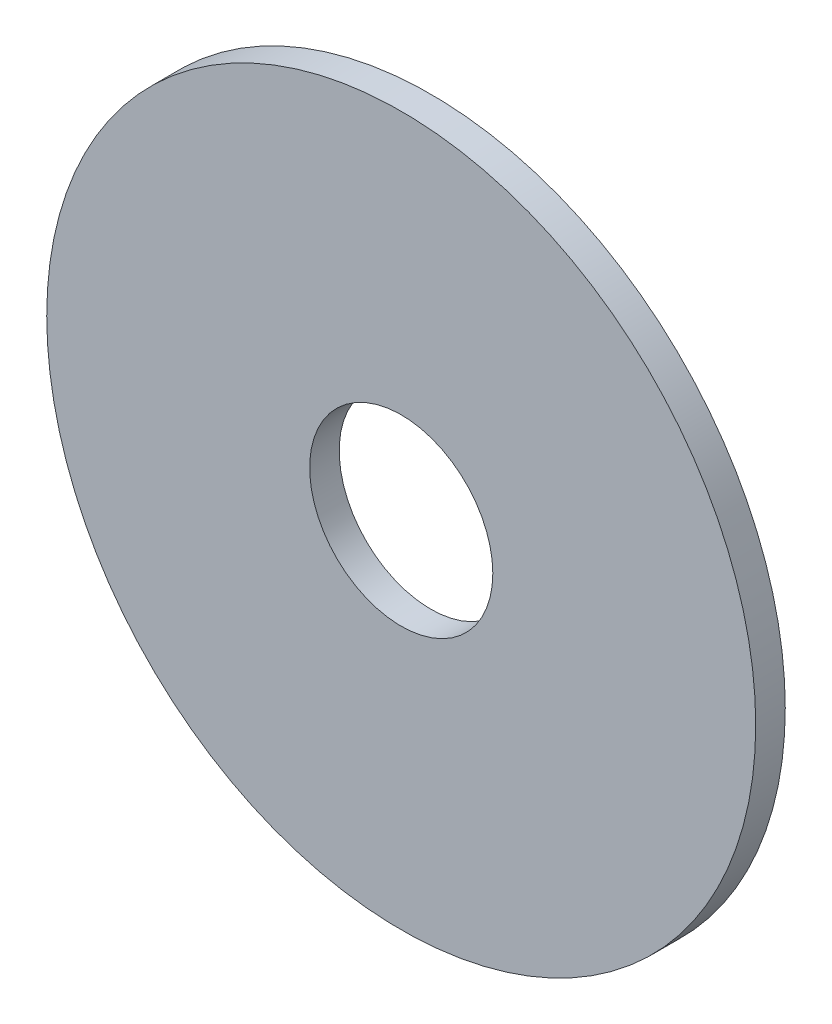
from build123d import *

# Parameters (mm, degrees)
ESQUISSE1_R        = 6
ESQUISSE1_R_2      = 1.55
BOSS_EXTRU_1_DEPTH = 0.5


with BuildPart() as part:
    # Esquisse1 → Boss.-Extru.1 (new body)
    with BuildSketch(Plane.XY):
        Circle(ESQUISSE1_R)
        Circle(ESQUISSE1_R_2, mode=Mode.SUBTRACT)
    extrude(amount=BOSS_EXTRU_1_DEPTH)


solid = part.part
